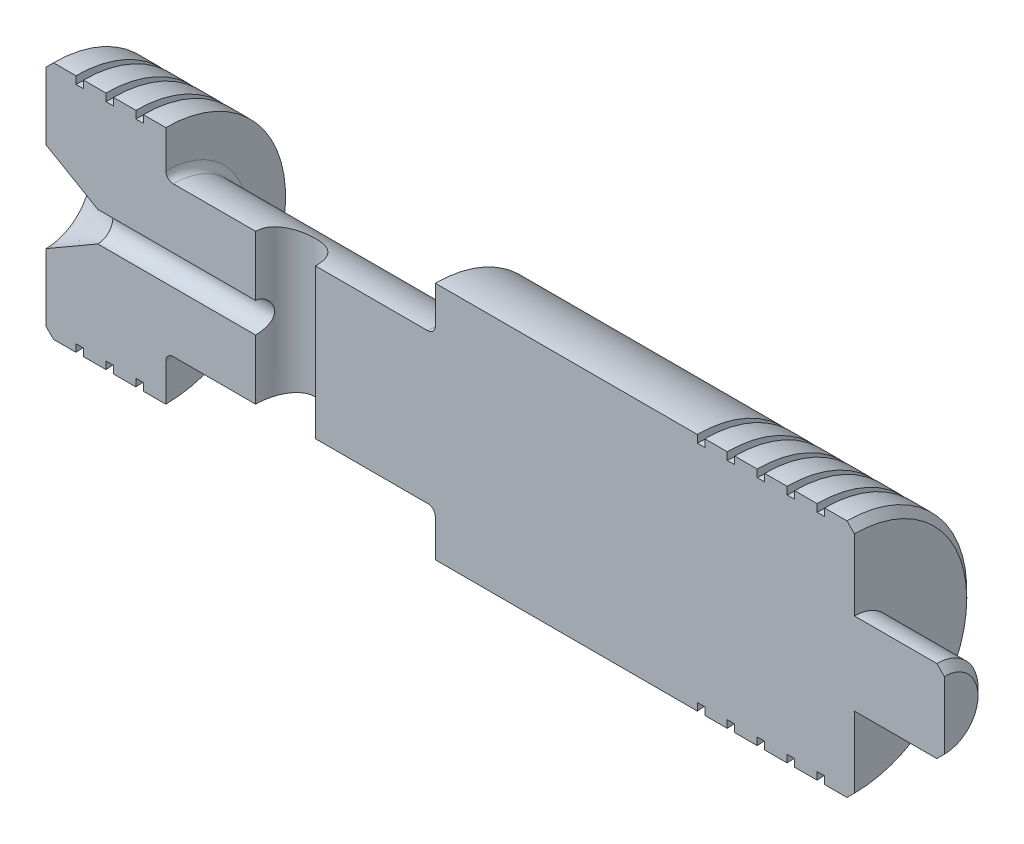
from build123d import *

# Parameters (mm, degrees)
CUT_EXTRUDE_1_DEPTH      = 62.05735009
CUT_EXTRUDE_1_DEPTH_BACK = 62.05735009
SKETCH_2_R               = 2
CUT_EXTRUDE_2_DEPTH      = 62.05735009
CUT_EXTRUDE_2_DEPTH_BACK = 62.05735009
SKETCH_3_W               = 64.244186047
SKETCH_3_H               = 12.596899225


with BuildPart() as part:
    # Sketch 1 → Revolve 1 (revolve)
    with BuildSketch(Plane.XY):
        with BuildLine():
            Line((0, 3), (0, 7.5))
            Line((0, 7.5), (0.5, 8))
            Line((0.5, 8), (2, 8))
            Line((2, 8), (2, 7.5))
            Line((2, 7.5), (2.5, 7.5))
            Line((2.5, 7.5), (2.5, 8))
            Line((2.5, 8), (4, 8))
            Line((4, 8), (4, 7.5))
            Line((4, 7.5), (4.5, 7.5))
            Line((4.5, 7.5), (4.5, 8))
            Line((4.5, 8), (6, 8))
            Line((6, 8), (6, 7.5))
            Line((6, 7.5), (6.5, 7.5))
            Line((6.5, 7.5), (6.5, 8))
            Line((6.5, 8), (8, 8))
            Line((8, 8), (8, 5.5))
            ThreePointArc((8, 5.5), (8.146446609, 5.146446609), (8.5, 5))
            Line((8.5, 5), (25.5, 5))
            ThreePointArc((25.5, 5), (25.853553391, 5.146446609), (26, 5.5))
            Line((26, 5.5), (26, 8))
            Line((26, 8), (26.5, 8))
            Line((26.5, 8), (43.5, 8))
            Line((43.5, 8), (43.5, 7.5))
            Line((43.5, 7.5), (44, 7.5))
            Line((44, 7.5), (44, 8))
            Line((44, 8), (45.5, 8))
            Line((45.5, 8), (45.5, 7.5))
            Line((45.5, 7.5), (46, 7.5))
            Line((46, 7.5), (46, 8))
            Line((46, 8), (47.5, 8))
            Line((47.5, 8), (47.5, 7.5))
            Line((47.5, 7.5), (48, 7.5))
            Line((48, 7.5), (48, 8))
            Line((48, 8), (49.5, 8))
            Line((49.5, 8), (49.5, 7.5))
            Line((49.5, 7.5), (50, 7.5))
            Line((50, 7.5), (50, 8))
            Line((50, 8), (51.5, 8))
            Line((51.5, 8), (51.5, 7.5))
            Line((51.5, 7.5), (52, 7.5))
            Line((52, 7.5), (52, 8))
            Line((52, 8), (53.5, 8))
            Line((53.5, 8), (54, 7.5))
            Line((54, 7.5), (54, 2.75))
            Line((54, 2.75), (59.5, 2.75))
            Line((59.5, 2.75), (60, 2.25))
            Line((60, 2.25), (60, 0))
            Line((60, 0), (16, 0))
            Line((16, 0), (16, 1))
            Line((16, 1), (3.464101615, 1))
            Line((3.464101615, 1), (0, 3))
        make_face()
    revolve(axis=Axis((0, 0, 0), (1, 0, 0)))

    # Sketch 2 → Cut-Extrude 1 (cut, two sides: drawn at the far end of the back side and taken through both)
    with BuildSketch(Plane(origin=(0, 0, 0), x_dir=(1, 0, 0), z_dir=(0, 1, 0)).offset(-CUT_EXTRUDE_1_DEPTH_BACK)):
        with Locations((16, 0)):
            Circle(SKETCH_2_R)
    extrude(amount=CUT_EXTRUDE_1_DEPTH + CUT_EXTRUDE_1_DEPTH_BACK, mode=Mode.SUBTRACT)

    # Sketch 3 → Cut-Extrude 2 (cut, two sides: drawn at the far end of the back side and taken through both)
    with BuildSketch(Plane(origin=(0, 0, 0), x_dir=(1, 0, 0), z_dir=(0, 1, 0)).offset(-CUT_EXTRUDE_2_DEPTH_BACK)):
        with Locations((28.98255814, -6.298449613)):
            Rectangle(SKETCH_3_W, SKETCH_3_H)
    extrude(amount=CUT_EXTRUDE_2_DEPTH + CUT_EXTRUDE_2_DEPTH_BACK, mode=Mode.SUBTRACT)


solid = part.part
